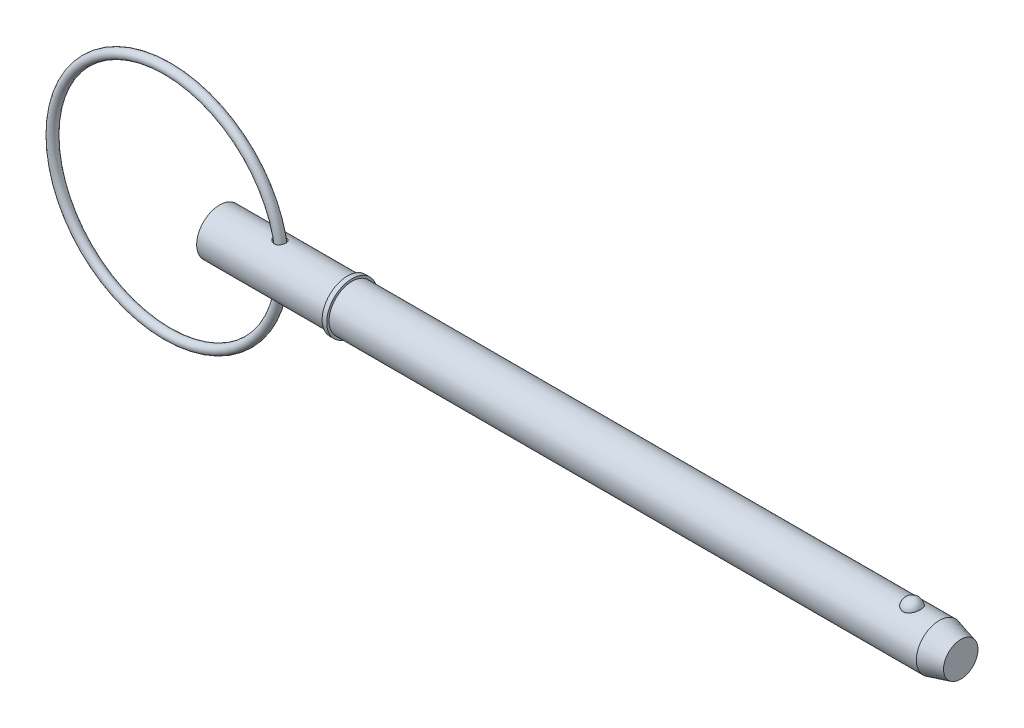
ISO-10303-21;
HEADER;
FILE_DESCRIPTION(('STEP AP214'),'2;1');
FILE_NAME('part.step','',(''),(''),'','','');
FILE_SCHEMA(('AUTOMOTIVE_DESIGN { 1 0 10303 214 1 1 1 1 }'));
ENDSEC;
DATA;
#1=APPLICATION_CONTEXT('core data for automotive mechanical design processes');
#2=APPLICATION_PROTOCOL_DEFINITION('international standard','automotive_design',2000,#1);
#3=PRODUCT_CONTEXT('',#1,'mechanical');
#4=PRODUCT('Part','Part','',(#3));
#5=PRODUCT_RELATED_PRODUCT_CATEGORY('part','',(#4));
#6=PRODUCT_DEFINITION_FORMATION('','',#4);
#7=PRODUCT_DEFINITION_CONTEXT('part definition',#1,'design');
#8=PRODUCT_DEFINITION('design','',#6,#7);
#9=PRODUCT_DEFINITION_SHAPE('','',#8);
#10=(LENGTH_UNIT() NAMED_UNIT(*) SI_UNIT(.MILLI.,.METRE.));
#11=(NAMED_UNIT(*) PLANE_ANGLE_UNIT() SI_UNIT($,.RADIAN.));
#12=(NAMED_UNIT(*) SI_UNIT($,.STERADIAN.) SOLID_ANGLE_UNIT());
#13=UNCERTAINTY_MEASURE_WITH_UNIT(LENGTH_MEASURE(1.E-05),#10,'distance_accuracy_value','');
#14=(GEOMETRIC_REPRESENTATION_CONTEXT(3) GLOBAL_UNCERTAINTY_ASSIGNED_CONTEXT((#13)) GLOBAL_UNIT_ASSIGNED_CONTEXT((#10,
#11,#12)) REPRESENTATION_CONTEXT('',''));
#15=CARTESIAN_POINT('',(0.,0.,0.));
#16=DIRECTION('',(0.,0.,1.));
#17=DIRECTION('',(1.,0.,0.));
#18=AXIS2_PLACEMENT_3D('',#15,#16,#17);
#19=CARTESIAN_POINT('',(-7.21857545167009,0.,0.));
#20=DIRECTION('',(0.,0.,1.));
#21=DIRECTION('',(1.,0.,0.));
#22=AXIS2_PLACEMENT_3D('',#19,#20,#21);
#23=TOROIDAL_SURFACE('',#22,15.875,0.634999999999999);
#24=CARTESIAN_POINT('',(9.29142454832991,0.,0.));
#25=VERTEX_POINT('',#24);
#26=VERTEX_LOOP('',#25);
#27=FACE_BOUND('',#26,.T.);
#28=ADVANCED_FACE('P0_F12',(#27),#23,.T.);
#29=CLOSED_SHELL('',(#28));
#30=MANIFOLD_SOLID_BREP('P0_B1',#29);
#31=CARTESIAN_POINT('',(0.,0.,0.));
#32=DIRECTION('',(1.,0.,0.));
#33=DIRECTION('',(0.,0.,-1.));
#34=AXIS2_PLACEMENT_3D('',#31,#32,#33);
#35=CYLINDRICAL_SURFACE('',#34,3.175);
#36=CARTESIAN_POINT('',(7.61208756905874,3.1556298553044,-0.35017883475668));
#37=CARTESIAN_POINT('',(7.63371620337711,3.15106857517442,-0.391277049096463));
#38=CARTESIAN_POINT('',(7.65900587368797,3.14590738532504,-0.430417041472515));
#39=CARTESIAN_POINT('',(7.71586762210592,3.13499707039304,-0.503788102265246));
#40=CARTESIAN_POINT('',(7.74745045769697,3.12924694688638,-0.538010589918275));
#41=CARTESIAN_POINT('',(7.81573449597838,3.11782384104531,-0.600675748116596));
#42=CARTESIAN_POINT('',(7.85242014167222,3.11215067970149,-0.629135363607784));
#43=CARTESIAN_POINT('',(7.9299616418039,3.10148180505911,-0.679784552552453));
#44=CARTESIAN_POINT('',(7.97081650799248,3.0964859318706,-0.701975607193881));
#45=CARTESIAN_POINT('',(8.05731415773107,3.08756286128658,-0.740259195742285));
#46=CARTESIAN_POINT('',(8.10308043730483,3.08368396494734,-0.756085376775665));
#47=CARTESIAN_POINT('',(8.19675033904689,3.07777545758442,-0.779791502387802));
#48=CARTESIAN_POINT('',(8.24465368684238,3.07574560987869,-0.787672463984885));
#49=CARTESIAN_POINT('',(8.33978659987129,3.07388057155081,-0.794919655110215));
#50=CARTESIAN_POINT('',(8.38699681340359,3.07398484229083,-0.794520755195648));
#51=CARTESIAN_POINT('',(8.48058476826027,3.07628376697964,-0.785572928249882));
#52=CARTESIAN_POINT('',(8.52696281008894,3.07847765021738,-0.777027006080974));
#53=CARTESIAN_POINT('',(8.61487038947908,3.08453758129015,-0.752595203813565));
#54=CARTESIAN_POINT('',(8.65652632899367,3.0883052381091,-0.737137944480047));
#55=CARTESIAN_POINT('',(8.73650065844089,3.09706199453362,-0.69943165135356));
#56=CARTESIAN_POINT('',(8.77481931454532,3.10205099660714,-0.677183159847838));
#57=CARTESIAN_POINT('',(8.84638246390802,3.11258194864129,-0.62697851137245));
#58=CARTESIAN_POINT('',(8.87970556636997,3.11811239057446,-0.599131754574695));
#59=CARTESIAN_POINT('',(8.94123162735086,3.12919300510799,-0.538266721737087));
#60=CARTESIAN_POINT('',(8.96943428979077,3.1347431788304,-0.505248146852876));
#61=CARTESIAN_POINT('',(9.02036334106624,3.14533698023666,-0.434482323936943));
#62=CARTESIAN_POINT('',(9.04301290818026,3.15037299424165,-0.396678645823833));
#63=CARTESIAN_POINT('',(9.08180072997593,3.15931021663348,-0.317742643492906));
#64=CARTESIAN_POINT('',(9.0979387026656,3.1632113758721,-0.27661017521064));
#65=CARTESIAN_POINT('',(9.12343544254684,3.16949230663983,-0.191753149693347));
#66=CARTESIAN_POINT('',(9.13272827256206,3.17185725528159,-0.148007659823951));
#67=CARTESIAN_POINT('',(9.14405176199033,3.17475043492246,-0.0595274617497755));
#68=CARTESIAN_POINT('',(9.14608246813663,3.17527867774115,-0.0147927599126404));
#69=CARTESIAN_POINT('',(9.1428335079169,3.1744420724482,0.0743443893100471));
#70=CARTESIAN_POINT('',(9.13756166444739,3.17307925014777,0.118747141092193));
#71=CARTESIAN_POINT('',(9.11985162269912,3.1686108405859,0.206009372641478));
#72=CARTESIAN_POINT('',(9.10741326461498,3.16550521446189,0.248868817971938));
#73=CARTESIAN_POINT('',(9.07566875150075,3.1578851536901,0.331849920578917));
#74=CARTESIAN_POINT('',(9.05635986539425,3.15337015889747,0.371970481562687));
#75=CARTESIAN_POINT('',(9.01134716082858,3.14342392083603,0.448324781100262));
#76=CARTESIAN_POINT('',(8.98564319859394,3.13799265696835,0.484558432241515));
#77=CARTESIAN_POINT('',(8.92847529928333,3.12681455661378,0.552114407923));
#78=CARTESIAN_POINT('',(8.89701024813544,3.12106765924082,0.583435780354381));
#79=CARTESIAN_POINT('',(8.82914631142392,3.10991074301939,0.640250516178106));
#80=CARTESIAN_POINT('',(8.79274799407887,3.10450068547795,0.665744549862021));
#81=CARTESIAN_POINT('',(8.71647895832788,3.09469918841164,0.709908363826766));
#82=CARTESIAN_POINT('',(8.6766541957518,3.09029650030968,0.728654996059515));
#83=CARTESIAN_POINT('',(8.59431583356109,3.08292493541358,0.759241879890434));
#84=CARTESIAN_POINT('',(8.55180254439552,3.07995589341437,0.771082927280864));
#85=CARTESIAN_POINT('',(8.46578539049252,3.07578939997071,0.787538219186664));
#86=CARTESIAN_POINT('',(8.42229655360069,3.07457372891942,0.792226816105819));
#87=CARTESIAN_POINT('',(8.33511786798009,3.07395008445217,0.794642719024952));
#88=CARTESIAN_POINT('',(8.29142799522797,3.07454233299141,0.792369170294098));
#89=CARTESIAN_POINT('',(8.20393675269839,3.07746038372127,0.7809593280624));
#90=CARTESIAN_POINT('',(8.16015857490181,3.07982804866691,0.771657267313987));
#91=CARTESIAN_POINT('',(8.07467704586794,3.08604667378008,0.746397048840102));
#92=CARTESIAN_POINT('',(8.03297433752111,3.08989809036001,0.730436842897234));
#93=CARTESIAN_POINT('',(7.95039160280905,3.09890222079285,0.691270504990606));
#94=CARTESIAN_POINT('',(7.90968495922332,3.10411517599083,0.667712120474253));
#95=CARTESIAN_POINT('',(7.83271969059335,3.1151281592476,0.614283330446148));
#96=CARTESIAN_POINT('',(7.79646250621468,3.12092837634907,0.584410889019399));
#97=CARTESIAN_POINT('',(7.72857688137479,3.13262084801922,0.518141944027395));
#98=CARTESIAN_POINT('',(7.69709348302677,3.13851156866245,0.481595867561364));
#99=CARTESIAN_POINT('',(7.64110131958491,3.14951669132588,0.403390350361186));
#100=CARTESIAN_POINT('',(7.61658964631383,3.15463141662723,0.361733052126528));
#101=CARTESIAN_POINT('',(7.57680170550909,3.16317869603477,0.276844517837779));
#102=CARTESIAN_POINT('',(7.56109307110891,3.16668805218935,0.233824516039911));
#103=CARTESIAN_POINT('',(7.53774475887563,3.17196948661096,0.145544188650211));
#104=CARTESIAN_POINT('',(7.53010042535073,3.17374256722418,0.100285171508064));
#105=CARTESIAN_POINT('',(7.52361520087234,3.17524561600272,0.0131362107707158));
#106=CARTESIAN_POINT('',(7.52405785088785,3.17514186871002,-0.0286991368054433));
#107=CARTESIAN_POINT('',(7.53198606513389,3.17330730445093,-0.11163297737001));
#108=CARTESIAN_POINT('',(7.53946515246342,3.17157798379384,-0.152732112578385));
#109=CARTESIAN_POINT('',(7.55761776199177,3.16747587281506,-0.220170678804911));
#110=CARTESIAN_POINT('',(7.56650761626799,3.16548510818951,-0.24703103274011));
#111=CARTESIAN_POINT('',(7.58717790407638,3.16094651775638,-0.299561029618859));
#112=CARTESIAN_POINT('',(7.59895820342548,3.15839871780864,-0.325230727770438));
#113=CARTESIAN_POINT('',(7.61208756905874,3.1556298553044,-0.35017883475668));
#114=B_SPLINE_CURVE_WITH_KNOTS('',3,(#36,#37,#38,#39,#40,#41,#42,#43,#44,#45,#46,#47,#48,#49,
#50,#51,#52,#53,#54,#55,#56,#57,#58,#59,#60,#61,#62,#63,#64,#65,#66,#67,#68,#69,#70,#71,#72,#73,
#74,#75,#76,#77,#78,#79,#80,#81,#82,#83,#84,#85,#86,#87,#88,#89,#90,#91,#92,#93,#94,#95,#96,#97,
#98,#99,#100,#101,#102,#103,#104,#105,#106,#107,#108,#109,#110,#111,#112,#113),.UNSPECIFIED.,
.T.,.F.,(4,2,2,2,2,2,2,2,2,2,2,2,2,2,2,2,2,2,2,2,2,2,2,2,2,2,2,2,2,2,2,2,2,2,2,2,2,2,4),(0.,
0.139884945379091,0.280011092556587,0.419719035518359,0.559393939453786,0.704422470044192,
0.849432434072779,0.990334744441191,1.13118510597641,1.26430449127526,1.39741324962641,
1.52813722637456,1.65886875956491,1.79131797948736,1.92377293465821,2.05748767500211,
2.19120155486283,2.32477230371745,2.45834603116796,2.5919729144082,2.72560280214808,
2.8592585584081,2.9928989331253,3.12496502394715,3.25701589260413,3.3876844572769,
3.51836906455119,3.65223598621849,3.78614411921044,3.92746618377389,4.06883388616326,
4.21388116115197,4.35886784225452,4.4959119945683,4.63287698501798,4.75777153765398,
4.88255123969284,4.9674704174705,5.05238565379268),.UNSPECIFIED.);
#115=CARTESIAN_POINT('',(7.61208756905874,3.1556298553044,-0.35017883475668));
#116=VERTEX_POINT('',#115);
#117=EDGE_CURVE('P1_E42',#116,#116,#114,.T.);
#118=ORIENTED_EDGE('',*,*,#117,.T.);
#119=EDGE_LOOP('',(#118));
#120=FACE_BOUND('',#119,.T.);
#121=CARTESIAN_POINT('',(0.,0.,0.));
#122=DIRECTION('',(1.,0.,0.));
#123=DIRECTION('',(0.,0.,-1.));
#124=AXIS2_PLACEMENT_3D('',#121,#122,#123);
#125=CIRCLE('',#124,3.175);
#126=CARTESIAN_POINT('',(0.,0.,-3.175));
#127=VERTEX_POINT('',#126);
#128=EDGE_CURVE('P1_E9',#127,#127,#125,.T.);
#129=ORIENTED_EDGE('',*,*,#128,.T.);
#130=EDGE_LOOP('',(#129));
#131=FACE_BOUND('',#130,.T.);
#132=CARTESIAN_POINT('',(17.655,0.,0.));
#133=DIRECTION('',(1.,0.,0.));
#134=DIRECTION('',(0.,0.,-1.));
#135=AXIS2_PLACEMENT_3D('',#132,#133,#134);
#136=CIRCLE('',#135,3.175);
#137=CARTESIAN_POINT('',(17.655,0.,-3.175));
#138=VERTEX_POINT('',#137);
#139=EDGE_CURVE('P1_E25',#138,#138,#136,.T.);
#140=ORIENTED_EDGE('',*,*,#139,.F.);
#141=EDGE_LOOP('',(#140));
#142=FACE_BOUND('',#141,.T.);
#143=CARTESIAN_POINT('',(7.61208756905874,-3.1556298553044,-0.35017883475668));
#144=CARTESIAN_POINT('',(7.59286963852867,-3.15968249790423,-0.313658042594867));
#145=CARTESIAN_POINT('',(7.57653057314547,-3.16326353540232,-0.275569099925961));
#146=CARTESIAN_POINT('',(7.55026251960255,-3.16911690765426,-0.197144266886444));
#147=CARTESIAN_POINT('',(7.5403309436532,-3.17138977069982,-0.156809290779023));
#148=CARTESIAN_POINT('',(7.52732229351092,-3.17438133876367,-0.0748996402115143));
#149=CARTESIAN_POINT('',(7.52425928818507,-3.17509685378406,-0.0333225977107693));
#150=CARTESIAN_POINT('',(7.52518511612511,-3.17488190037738,0.0497488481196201));
#151=CARTESIAN_POINT('',(7.52917391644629,-3.17395143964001,0.0912432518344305));
#152=CARTESIAN_POINT('',(7.5438119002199,-3.17059494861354,0.171876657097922));
#153=CARTESIAN_POINT('',(7.55428987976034,-3.16820738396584,0.211048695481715));
#154=CARTESIAN_POINT('',(7.58129107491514,-3.16221942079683,0.287144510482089));
#155=CARTESIAN_POINT('',(7.59781536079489,-3.15861880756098,0.324067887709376));
#156=CARTESIAN_POINT('',(7.63709105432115,-3.15038497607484,0.39633030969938));
#157=CARTESIAN_POINT('',(7.66007308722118,-3.14571500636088,0.431539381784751));
#158=CARTESIAN_POINT('',(7.71115516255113,-3.1358897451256,0.497945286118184));
#159=CARTESIAN_POINT('',(7.73925713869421,-3.13073427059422,0.529140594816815));
#160=CARTESIAN_POINT('',(7.80245490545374,-3.11995925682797,0.589491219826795));
#161=CARTESIAN_POINT('',(7.83794667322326,-3.11433841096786,0.618232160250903));
#162=CARTESIAN_POINT('',(7.91311816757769,-3.10367079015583,0.669735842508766));
#163=CARTESIAN_POINT('',(7.9527994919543,-3.09862423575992,0.692496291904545));
#164=CARTESIAN_POINT('',(8.0376108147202,-3.08940933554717,0.732544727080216));
#165=CARTESIAN_POINT('',(8.08291928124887,-3.08530306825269,0.749471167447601));
#166=CARTESIAN_POINT('',(8.17586222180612,-3.07887185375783,0.775470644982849));
#167=CARTESIAN_POINT('',(8.22349631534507,-3.07654661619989,0.784544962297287));
#168=CARTESIAN_POINT('',(8.31855368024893,-3.0740583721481,0.794238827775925));
#169=CARTESIAN_POINT('',(8.365955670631,-3.0738459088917,0.795051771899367));
#170=CARTESIAN_POINT('',(8.46014660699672,-3.07554059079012,0.788471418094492));
#171=CARTESIAN_POINT('',(8.50693577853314,-3.07744693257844,0.781081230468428));
#172=CARTESIAN_POINT('',(8.59580031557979,-3.08301185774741,0.75880456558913));
#173=CARTESIAN_POINT('',(8.63799306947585,-3.0865668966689,0.744358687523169));
#174=CARTESIAN_POINT('',(8.71919510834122,-3.09498125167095,0.708556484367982));
#175=CARTESIAN_POINT('',(8.75820469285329,-3.09984044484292,0.687200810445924));
#176=CARTESIAN_POINT('',(8.83112932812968,-3.11018970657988,0.638704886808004));
#177=CARTESIAN_POINT('',(8.86513521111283,-3.11566412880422,0.6116975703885));
#178=CARTESIAN_POINT('',(8.92814452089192,-3.1267232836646,0.552389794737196));
#179=CARTESIAN_POINT('',(8.95714769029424,-3.13230802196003,0.520089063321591));
#180=CARTESIAN_POINT('',(9.00975680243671,-3.1430519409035,0.450661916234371));
#181=CARTESIAN_POINT('',(9.03329284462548,-3.14820512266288,0.413481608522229));
#182=CARTESIAN_POINT('',(9.07393955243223,-3.15745247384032,0.335639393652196));
#183=CARTESIAN_POINT('',(9.09104990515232,-3.16154659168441,0.294977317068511));
#184=CARTESIAN_POINT('',(9.11857731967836,-3.16827429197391,0.21085639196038));
#185=CARTESIAN_POINT('',(9.12892253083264,-3.1708921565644,0.167372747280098));
#186=CARTESIAN_POINT('',(9.14237674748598,-3.17431758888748,0.0792307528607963));
#187=CARTESIAN_POINT('',(9.14548579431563,-3.17512516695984,0.0345724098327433));
#188=CARTESIAN_POINT('',(9.14439142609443,-3.17484319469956,-0.0546175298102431));
#189=CARTESIAN_POINT('',(9.14019308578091,-3.17375496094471,-0.0991491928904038));
#190=CARTESIAN_POINT('',(9.12459742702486,-3.16980106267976,-0.186852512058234));
#191=CARTESIAN_POINT('',(9.11319997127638,-3.16693536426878,-0.230024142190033));
#192=CARTESIAN_POINT('',(9.08348483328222,-3.15973571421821,-0.313789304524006));
#193=CARTESIAN_POINT('',(9.06516665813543,-3.15540165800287,-0.354382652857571));
#194=CARTESIAN_POINT('',(9.02205745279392,-3.14573679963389,-0.431845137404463));
#195=CARTESIAN_POINT('',(8.99726624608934,-3.14040597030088,-0.468714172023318));
#196=CARTESIAN_POINT('',(8.94180687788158,-3.12933254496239,-0.53770470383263));
#197=CARTESIAN_POINT('',(8.91113471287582,-3.12358967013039,-0.569822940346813));
#198=CARTESIAN_POINT('',(8.84472020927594,-3.11234460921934,-0.628352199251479));
#199=CARTESIAN_POINT('',(8.80897839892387,-3.10684239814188,-0.654763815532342));
#200=CARTESIAN_POINT('',(8.73381844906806,-3.0967672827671,-0.700864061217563));
#201=CARTESIAN_POINT('',(8.69444454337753,-3.09218491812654,-0.720622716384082));
#202=CARTESIAN_POINT('',(8.61282389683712,-3.08439406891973,-0.75327416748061));
#203=CARTESIAN_POINT('',(8.57057751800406,-3.08118541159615,-0.766167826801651));
#204=CARTESIAN_POINT('',(8.48495851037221,-3.07651651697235,-0.784705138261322));
#205=CARTESIAN_POINT('',(8.44160497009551,-3.07503616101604,-0.7904322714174));
#206=CARTESIAN_POINT('',(8.35452054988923,-3.07388232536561,-0.794907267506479));
#207=CARTESIAN_POINT('',(8.31078963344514,-3.07420902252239,-0.793654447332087));
#208=CARTESIAN_POINT('',(8.22319164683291,-3.07661365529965,-0.784281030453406));
#209=CARTESIAN_POINT('',(8.17934121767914,-3.07872844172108,-0.776015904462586));
#210=CARTESIAN_POINT('',(8.09354825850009,-3.08448489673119,-0.752807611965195));
#211=CARTESIAN_POINT('',(8.05160636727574,-3.08812707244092,-0.737862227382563));
#212=CARTESIAN_POINT('',(7.9683964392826,-3.09676294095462,-0.700760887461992));
#213=CARTESIAN_POINT('',(7.92729071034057,-3.10181965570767,-0.678255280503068));
#214=CARTESIAN_POINT('',(7.84934481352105,-3.11260576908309,-0.626894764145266));
#215=CARTESIAN_POINT('',(7.81250545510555,-3.11833529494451,-0.598038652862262));
#216=CARTESIAN_POINT('',(7.74486652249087,-3.12971026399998,-0.535287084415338));
#217=CARTESIAN_POINT('',(7.71395414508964,-3.13535486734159,-0.50151327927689));
#218=CARTESIAN_POINT('',(7.65821444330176,-3.14606907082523,-0.429192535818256));
#219=CARTESIAN_POINT('',(7.63338346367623,-3.15113901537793,-0.390648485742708));
#220=CARTESIAN_POINT('',(7.61208756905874,-3.1556298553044,-0.35017883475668));
#221=B_SPLINE_CURVE_WITH_KNOTS('',3,(#143,#144,#145,#146,#147,#148,#149,#150,#151,#152,#153,
#154,#155,#156,#157,#158,#159,#160,#161,#162,#163,#164,#165,#166,#167,#168,#169,#170,#171,#172,
#173,#174,#175,#176,#177,#178,#179,#180,#181,#182,#183,#184,#185,#186,#187,#188,#189,#190,#191,
#192,#193,#194,#195,#196,#197,#198,#199,#200,#201,#202,#203,#204,#205,#206,#207,#208,#209,#210,
#211,#212,#213,#214,#215,#216,#217,#218,#219,#220),.UNSPECIFIED.,.T.,.F.,(4,2,2,2,2,2,2,2,2,2,2,
2,2,2,2,2,2,2,2,2,2,2,2,2,2,2,2,2,2,2,2,2,2,2,2,2,2,2,4),(0.,0.124257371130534,0.24846452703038,
0.372925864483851,0.497386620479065,0.618695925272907,0.740026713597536,0.86640919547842,
0.992839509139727,1.13028244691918,1.26777799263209,1.41269245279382,1.55758328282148,
1.69907422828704,1.84051154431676,1.97406862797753,2.10761312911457,2.23831247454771,
2.36901854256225,2.5013136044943,2.63361510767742,2.76729986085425,2.90098385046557,
3.03457503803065,3.16816877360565,3.3017720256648,3.43537892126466,3.56907709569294,
3.70276134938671,3.83499098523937,3.96720398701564,4.09786208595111,4.22853297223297,
4.36196440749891,4.49544017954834,4.63621591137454,4.77701830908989,4.91479418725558,
5.05248705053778),.UNSPECIFIED.);
#222=CARTESIAN_POINT('',(7.61208756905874,-3.1556298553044,-0.35017883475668));
#223=VERTEX_POINT('',#222);
#224=EDGE_CURVE('P1_E17',#223,#223,#221,.T.);
#225=ORIENTED_EDGE('',*,*,#224,.T.);
#226=EDGE_LOOP('',(#225));
#227=FACE_BOUND('',#226,.T.);
#228=ADVANCED_FACE('P1_F13',(#120,#131,#142,#227),#35,.T.);
#229=CARTESIAN_POINT('',(0.,0.,0.));
#230=DIRECTION('',(1.,0.,0.));
#231=DIRECTION('',(0.,0.,-1.));
#232=AXIS2_PLACEMENT_3D('',#229,#230,#231);
#233=CYLINDRICAL_SURFACE('',#232,3.175);
#234=CARTESIAN_POINT('',(99.4476846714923,0.,0.));
#235=DIRECTION('',(1.,0.,0.));
#236=DIRECTION('',(0.,0.,-1.));
#237=AXIS2_PLACEMENT_3D('',#234,#235,#236);
#238=CIRCLE('',#237,3.175);
#239=CARTESIAN_POINT('',(99.4476846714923,0.,-3.175));
#240=VERTEX_POINT('',#239);
#241=EDGE_CURVE('P1_E99',#240,#240,#238,.T.);
#242=ORIENTED_EDGE('',*,*,#241,.F.);
#243=EDGE_LOOP('',(#242));
#244=FACE_BOUND('',#243,.T.);
#245=CARTESIAN_POINT('',(18.29,0.,0.));
#246=DIRECTION('',(1.,0.,0.));
#247=DIRECTION('',(0.,0.,-1.));
#248=AXIS2_PLACEMENT_3D('',#245,#246,#247);
#249=CIRCLE('',#248,3.175);
#250=CARTESIAN_POINT('',(18.29,0.,-3.175));
#251=VERTEX_POINT('',#250);
#252=EDGE_CURVE('P1_E96',#251,#251,#249,.T.);
#253=ORIENTED_EDGE('',*,*,#252,.T.);
#254=EDGE_LOOP('',(#253));
#255=FACE_BOUND('',#254,.T.);
#256=CARTESIAN_POINT('',(95.6757276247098,2.92898950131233,1.2254164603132));
#257=CARTESIAN_POINT('',(95.612316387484,2.92899434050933,1.22541146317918));
#258=CARTESIAN_POINT('',(95.5487979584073,2.93112688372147,1.2203464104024));
#259=CARTESIAN_POINT('',(95.4235306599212,2.93942752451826,1.20020949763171));
#260=CARTESIAN_POINT('',(95.3617869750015,2.9456063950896,1.1851109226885));
#261=CARTESIAN_POINT('',(95.2420651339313,2.96127115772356,1.14540352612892));
#262=CARTESIAN_POINT('',(95.1840775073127,2.97074831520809,1.12081980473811));
#263=CARTESIAN_POINT('',(95.0731943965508,2.99197584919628,1.06285154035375));
#264=CARTESIAN_POINT('',(95.0202966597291,3.0037252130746,1.02947091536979));
#265=CARTESIAN_POINT('',(94.9192688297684,3.02865714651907,0.953674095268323));
#266=CARTESIAN_POINT('',(94.871324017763,3.04187163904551,0.911021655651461));
#267=CARTESIAN_POINT('',(94.7830360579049,3.06808741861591,0.818400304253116));
#268=CARTESIAN_POINT('',(94.7426952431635,3.08108863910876,0.768429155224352));
#269=CARTESIAN_POINT('',(94.6688039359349,3.10614903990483,0.660064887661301));
#270=CARTESIAN_POINT('',(94.6356330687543,3.11814104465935,0.601396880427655));
#271=CARTESIAN_POINT('',(94.5791190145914,3.13926931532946,0.479026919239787));
#272=CARTESIAN_POINT('',(94.5557764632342,3.14840539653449,0.415324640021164));
#273=CARTESIAN_POINT('',(94.5191785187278,3.16298160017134,0.283885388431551));
#274=CARTESIAN_POINT('',(94.5060407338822,3.16837855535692,0.216110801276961));
#275=CARTESIAN_POINT('',(94.4905676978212,3.17475386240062,0.0791367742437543));
#276=CARTESIAN_POINT('',(94.488232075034,3.17573236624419,0.00993738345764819));
#277=CARTESIAN_POINT('',(94.4943886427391,3.17318075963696,-0.12742069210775));
#278=CARTESIAN_POINT('',(94.5028073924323,3.16968122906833,-0.19558325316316));
#279=CARTESIAN_POINT('',(94.5301752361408,3.1585790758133,-0.329413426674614));
#280=CARTESIAN_POINT('',(94.5491245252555,3.15097637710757,-0.395080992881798));
#281=CARTESIAN_POINT('',(94.5972057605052,3.13242485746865,-0.522180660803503));
#282=CARTESIAN_POINT('',(94.6263524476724,3.12147119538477,-0.583606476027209));
#283=CARTESIAN_POINT('',(94.6942352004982,3.09734973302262,-0.700436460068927));
#284=CARTESIAN_POINT('',(94.732972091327,3.08418174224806,-0.755840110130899));
#285=CARTESIAN_POINT('',(94.8194771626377,3.05694884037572,-0.859404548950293));
#286=CARTESIAN_POINT('',(94.8672961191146,3.04287919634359,-0.907521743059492));
#287=CARTESIAN_POINT('',(94.9707353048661,3.01548927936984,-0.994758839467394));
#288=CARTESIAN_POINT('',(95.0263549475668,3.0021689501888,-1.03387941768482));
#289=CARTESIAN_POINT('',(95.1428093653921,2.97810316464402,-1.10126594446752));
#290=CARTESIAN_POINT('',(95.2035182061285,2.96731170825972,-1.12973256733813));
#291=CARTESIAN_POINT('',(95.3293712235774,2.94928934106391,-1.17598467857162));
#292=CARTESIAN_POINT('',(95.3945137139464,2.94205708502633,-1.19377420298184));
#293=CARTESIAN_POINT('',(95.5238562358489,2.93233065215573,-1.21746387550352));
#294=CARTESIAN_POINT('',(95.5879385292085,2.92961621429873,-1.22391763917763));
#295=CARTESIAN_POINT('',(95.7163375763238,2.92855752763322,-1.22644976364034));
#296=CARTESIAN_POINT('',(95.7806542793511,2.93021238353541,-1.22253024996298));
#297=CARTESIAN_POINT('',(95.9055239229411,2.9375685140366,-1.20474140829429));
#298=CARTESIAN_POINT('',(95.966131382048,2.94313790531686,-1.19119621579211));
#299=CARTESIAN_POINT('',(96.0841106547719,2.95756226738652,-1.15491492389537));
#300=CARTESIAN_POINT('',(96.1414822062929,2.96641750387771,-1.13217808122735));
#301=CARTESIAN_POINT('',(96.2527699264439,2.98669918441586,-1.07755083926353));
#302=CARTESIAN_POINT('',(96.3065845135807,2.9981771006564,-1.0454730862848));
#303=CARTESIAN_POINT('',(96.4081473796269,3.02240235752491,-0.973220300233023));
#304=CARTESIAN_POINT('',(96.4558942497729,3.03514999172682,-0.933043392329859));
#305=CARTESIAN_POINT('',(96.5465817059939,3.06131230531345,-0.843372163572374));
#306=CARTESIAN_POINT('',(96.5891588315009,3.07472822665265,-0.793510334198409));
#307=CARTESIAN_POINT('',(96.6656765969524,3.10021106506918,-0.687241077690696));
#308=CARTESIAN_POINT('',(96.6996156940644,3.1122777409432,-0.630832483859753));
#309=CARTESIAN_POINT('',(96.7591209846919,3.134208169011,-0.511059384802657));
#310=CARTESIAN_POINT('',(96.7843892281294,3.14399040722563,-0.447531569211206));
#311=CARTESIAN_POINT('',(96.8245117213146,3.15983820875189,-0.31682749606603));
#312=CARTESIAN_POINT('',(96.8393659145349,3.16590375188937,-0.249651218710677));
#313=CARTESIAN_POINT('',(96.858358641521,3.17370076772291,-0.113549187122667));
#314=CARTESIAN_POINT('',(96.8624966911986,3.17543204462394,-0.044623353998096));
#315=CARTESIAN_POINT('',(96.8599697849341,3.17438372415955,0.0929938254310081));
#316=CARTESIAN_POINT('',(96.8533050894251,3.17160423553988,0.161685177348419));
#317=CARTESIAN_POINT('',(96.8293754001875,3.1618438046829,0.296502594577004));
#318=CARTESIAN_POINT('',(96.8121674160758,3.15488546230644,0.362640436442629));
#319=CARTESIAN_POINT('',(96.767547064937,3.13748892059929,0.490896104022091));
#320=CARTESIAN_POINT('',(96.7401339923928,3.12705048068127,0.553013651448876));
#321=CARTESIAN_POINT('',(96.6754626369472,3.10369139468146,0.671876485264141));
#322=CARTESIAN_POINT('',(96.6381467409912,3.0907563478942,0.728587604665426));
#323=CARTESIAN_POINT('',(96.5545246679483,3.06381731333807,0.834653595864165));
#324=CARTESIAN_POINT('',(96.5082189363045,3.04981337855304,0.884008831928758));
#325=CARTESIAN_POINT('',(96.407718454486,3.02230423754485,0.973916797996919));
#326=CARTESIAN_POINT('',(96.353535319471,3.00879833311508,1.01448227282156));
#327=CARTESIAN_POINT('',(96.2385299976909,2.98383625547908,1.0857155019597));
#328=CARTESIAN_POINT('',(96.1777053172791,2.9723808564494,1.11637952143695));
#329=CARTESIAN_POINT('',(96.0533690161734,2.95329063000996,1.16592590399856));
#330=CARTESIAN_POINT('',(95.9900230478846,2.9455373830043,1.18517901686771));
#331=CARTESIAN_POINT('',(95.8607664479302,2.9342556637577,1.21284802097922));
#332=CARTESIAN_POINT('',(95.7948641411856,2.93071450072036,1.2212964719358));
#333=CARTESIAN_POINT('',(95.711116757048,2.9291525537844,1.22502505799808));
#334=CARTESIAN_POINT('',(95.6934263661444,2.92898815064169,1.22541785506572));
#335=CARTESIAN_POINT('',(95.6757276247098,2.92898950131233,1.2254164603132));
#336=B_SPLINE_CURVE_WITH_KNOTS('',3,(#256,#257,#258,#259,#260,#261,#262,#263,#264,#265,#266,
#267,#268,#269,#270,#271,#272,#273,#274,#275,#276,#277,#278,#279,#280,#281,#282,#283,#284,#285,
#286,#287,#288,#289,#290,#291,#292,#293,#294,#295,#296,#297,#298,#299,#300,#301,#302,#303,#304,
#305,#306,#307,#308,#309,#310,#311,#312,#313,#314,#315,#316,#317,#318,#319,#320,#321,#322,#323,
#324,#325,#326,#327,#328,#329,#330,#331,#332,#333,#334,#335),.UNSPECIFIED.,.T.,.F.,(4,2,2,2,2,2,
2,2,2,2,2,2,2,2,2,2,2,2,2,2,2,2,2,2,2,2,2,2,2,2,2,2,2,2,2,2,2,2,2,4),(0.,0.190186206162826,
0.380880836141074,0.571074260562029,0.76118311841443,0.956866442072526,1.15260970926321,
1.35701770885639,1.56143892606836,1.76818248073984,1.97491892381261,2.18025109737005,
2.38558707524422,2.59122111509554,2.79687285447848,3.00371012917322,3.21053185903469,
3.41323429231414,3.61586005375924,3.80828192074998,4.00066436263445,4.18685798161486,
4.37306665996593,4.56330302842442,4.75358348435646,4.95345287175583,5.15335793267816,
5.35957003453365,5.56578325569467,5.77200579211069,5.97822335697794,6.18333558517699,
6.38846199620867,6.59480900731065,6.80114579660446,7.00718137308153,7.21329457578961,
7.41228022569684,7.6106648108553,7.66374777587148),.UNSPECIFIED.);
#337=CARTESIAN_POINT('',(95.6757276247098,2.92898950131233,1.2254164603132));
#338=VERTEX_POINT('',#337);
#339=EDGE_CURVE('P1_E34',#338,#338,#336,.T.);
#340=ORIENTED_EDGE('',*,*,#339,.T.);
#341=EDGE_LOOP('',(#340));
#342=FACE_BOUND('',#341,.T.);
#343=ADVANCED_FACE('P1_F46',(#244,#255,#342),#233,.T.);
#344=CARTESIAN_POINT('',(0.,0.,0.));
#345=DIRECTION('',(-1.,0.,0.));
#346=DIRECTION('',(0.,0.,1.));
#347=AXIS2_PLACEMENT_3D('',#344,#345,#346);
#348=PLANE('',#347);
#349=ORIENTED_EDGE('',*,*,#128,.F.);
#350=EDGE_LOOP('',(#349));
#351=FACE_BOUND('',#350,.T.);
#352=ADVANCED_FACE('P1_F15',(#351),#348,.T.);
#353=CARTESIAN_POINT('',(17.655,3.175,0.));
#354=DIRECTION('',(-1.,0.,0.));
#355=DIRECTION('',(0.,0.,1.));
#356=AXIS2_PLACEMENT_3D('',#353,#354,#355);
#357=PLANE('',#356);
#358=ORIENTED_EDGE('',*,*,#139,.T.);
#359=EDGE_LOOP('',(#358));
#360=FACE_BOUND('',#359,.T.);
#361=CARTESIAN_POINT('',(17.655,0.,0.));
#362=DIRECTION('',(1.,0.,0.));
#363=DIRECTION('',(0.,0.,-1.));
#364=AXIS2_PLACEMENT_3D('',#361,#362,#363);
#365=CIRCLE('',#364,3.4925);
#366=CARTESIAN_POINT('',(17.655,0.,-3.4925));
#367=VERTEX_POINT('',#366);
#368=EDGE_CURVE('P1_E30',#367,#367,#365,.T.);
#369=ORIENTED_EDGE('',*,*,#368,.F.);
#370=EDGE_LOOP('',(#369));
#371=FACE_BOUND('',#370,.T.);
#372=ADVANCED_FACE('P1_F81',(#360,#371),#357,.T.);
#373=CARTESIAN_POINT('',(0.,0.,0.));
#374=DIRECTION('',(1.,0.,0.));
#375=DIRECTION('',(0.,0.,-1.));
#376=AXIS2_PLACEMENT_3D('',#373,#374,#375);
#377=CYLINDRICAL_SURFACE('',#376,3.4925);
#378=ORIENTED_EDGE('',*,*,#368,.T.);
#379=EDGE_LOOP('',(#378));
#380=FACE_BOUND('',#379,.T.);
#381=CARTESIAN_POINT('',(18.29,0.,0.));
#382=DIRECTION('',(1.,0.,0.));
#383=DIRECTION('',(0.,0.,-1.));
#384=AXIS2_PLACEMENT_3D('',#381,#382,#383);
#385=CIRCLE('',#384,3.4925);
#386=CARTESIAN_POINT('',(18.29,0.,-3.4925));
#387=VERTEX_POINT('',#386);
#388=EDGE_CURVE('P1_E95',#387,#387,#385,.T.);
#389=ORIENTED_EDGE('',*,*,#388,.F.);
#390=EDGE_LOOP('',(#389));
#391=FACE_BOUND('',#390,.T.);
#392=ADVANCED_FACE('P1_F68',(#380,#391),#377,.T.);
#393=CARTESIAN_POINT('',(18.29,3.4925,0.));
#394=DIRECTION('',(1.,0.,0.));
#395=DIRECTION('',(0.,0.,-1.));
#396=AXIS2_PLACEMENT_3D('',#393,#394,#395);
#397=PLANE('',#396);
#398=ORIENTED_EDGE('',*,*,#388,.T.);
#399=EDGE_LOOP('',(#398));
#400=FACE_BOUND('',#399,.T.);
#401=ORIENTED_EDGE('',*,*,#252,.F.);
#402=EDGE_LOOP('',(#401));
#403=FACE_BOUND('',#402,.T.);
#404=ADVANCED_FACE('P1_F62',(#400,#403),#397,.T.);
#405=CARTESIAN_POINT('',(102.41,0.,0.));
#406=DIRECTION('',(-1.,0.,0.));
#407=DIRECTION('',(0.,0.,1.));
#408=AXIS2_PLACEMENT_3D('',#405,#406,#407);
#409=CONICAL_SURFACE('',#408,2.38125000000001,0.261799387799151);
#410=ORIENTED_EDGE('',*,*,#241,.T.);
#411=EDGE_LOOP('',(#410));
#412=FACE_BOUND('',#411,.T.);
#413=CARTESIAN_POINT('',(102.41,0.,0.));
#414=DIRECTION('',(1.,0.,0.));
#415=DIRECTION('',(0.,0.,-1.));
#416=AXIS2_PLACEMENT_3D('',#413,#414,#415);
#417=CIRCLE('',#416,2.38125000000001);
#418=CARTESIAN_POINT('',(102.41,0.,-2.38125000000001));
#419=VERTEX_POINT('',#418);
#420=EDGE_CURVE('P1_E41',#419,#419,#417,.T.);
#421=ORIENTED_EDGE('',*,*,#420,.F.);
#422=EDGE_LOOP('',(#421));
#423=FACE_BOUND('',#422,.T.);
#424=ADVANCED_FACE('P1_F59',(#412,#423),#409,.T.);
#425=CARTESIAN_POINT('',(102.41,2.38125000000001,0.));
#426=DIRECTION('',(1.,0.,0.));
#427=DIRECTION('',(0.,0.,-1.));
#428=AXIS2_PLACEMENT_3D('',#425,#426,#427);
#429=PLANE('',#428);
#430=ORIENTED_EDGE('',*,*,#420,.T.);
#431=EDGE_LOOP('',(#430));
#432=FACE_BOUND('',#431,.T.);
#433=ADVANCED_FACE('P1_F55',(#432),#429,.T.);
#434=CARTESIAN_POINT('',(95.6757276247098,2.85749999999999,0.));
#435=DIRECTION('',(-1.,0.,0.));
#436=DIRECTION('',(0.,1.,0.));
#437=AXIS2_PLACEMENT_3D('',#434,#435,#436);
#438=SPHERICAL_SURFACE('',#437,1.22750000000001);
#439=ORIENTED_EDGE('',*,*,#339,.F.);
#440=EDGE_LOOP('',(#439));
#441=FACE_BOUND('',#440,.T.);
#442=ADVANCED_FACE('P1_F50',(#441),#438,.T.);
#443=CARTESIAN_POINT('',(-7.21857545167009,0.,0.));
#444=DIRECTION('',(0.,0.,1.));
#445=DIRECTION('',(1.,0.,0.));
#446=AXIS2_PLACEMENT_3D('',#443,#444,#445);
#447=TOROIDAL_SURFACE('',#446,15.875,0.793749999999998);
#448=ORIENTED_EDGE('',*,*,#224,.F.);
#449=EDGE_LOOP('',(#448));
#450=FACE_BOUND('',#449,.T.);
#451=ORIENTED_EDGE('',*,*,#117,.F.);
#452=EDGE_LOOP('',(#451));
#453=FACE_BOUND('',#452,.T.);
#454=ADVANCED_FACE('P1_F54',(#450,#453),#447,.F.);
#455=CLOSED_SHELL('',(#228,#343,#352,#372,#392,#404,#424,#433,#442,#454));
#456=MANIFOLD_SOLID_BREP('P1_B1',#455);
#457=ADVANCED_BREP_SHAPE_REPRESENTATION('',(#18,#30,#456),#14);
#458=SHAPE_DEFINITION_REPRESENTATION(#9,#457);
ENDSEC;
END-ISO-10303-21;
